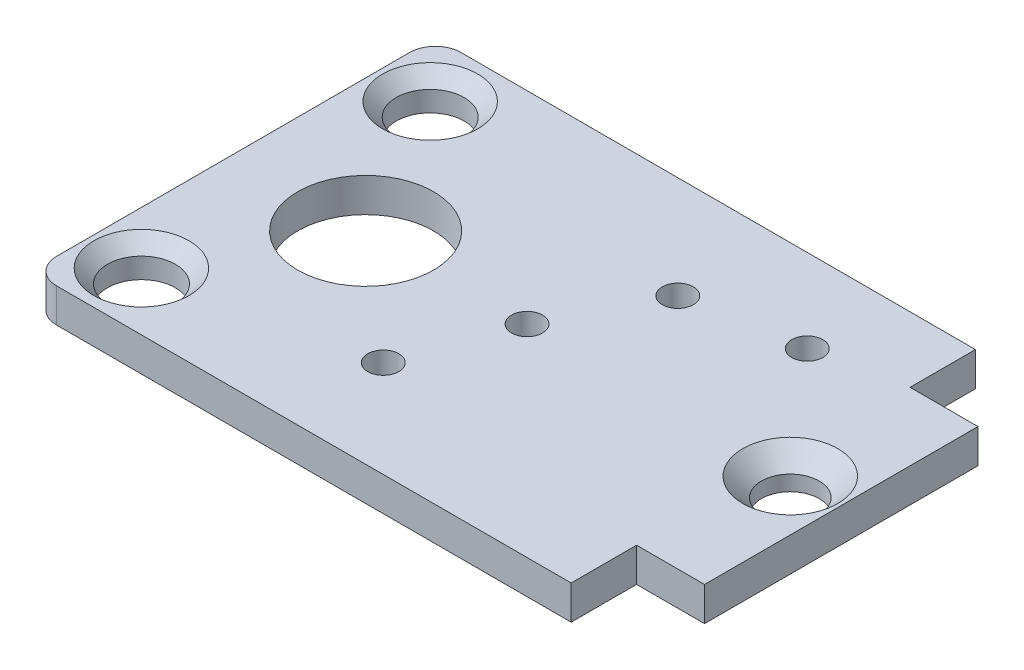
from build123d import *

# Parameters (mm, degrees)
SKETCH1_R           = 2
BOSS_EXTRUDE1_DEPTH = 1
SKETCH2_R           = 1
CUT_EXTRUDE1_DEPTH  = 16.244753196
FILLET1_R           = 0.75
CHAMFER1_SIZE       = 0.4
SKETCH3_R           = 0.4572
CUT_EXTRUDE2_DEPTH  = 16.244753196


with BuildPart() as part:
    # Sketch1 → Boss-Extrude1 (new body)
    with BuildSketch(Plane(origin=(0, 0, 0), x_dir=(1, 0, 0), z_dir=(0, 1, 0))):
        Polygon((12, 5.95), (-3.9, 5.95), (-3.9, -5.95), (12, -5.95), (12, -4.025), (14, -4.025), (14, 4.025), (12, 4.025), align=None)
        with Locations(Location((0, 0, 0), (0, 0, 270))):
            Circle(SKETCH1_R, mode=Mode.SUBTRACT)
    extrude(amount=BOSS_EXTRUDE1_DEPTH)

    # Sketch2 → Cut-Extrude1 (cut, through all)
    with BuildSketch(Plane(origin=(0, 1, 0), x_dir=(1, 0, 0), z_dir=(0, 1, 0))):
        with Locations(Location((-2.35, 4.25, 0), (0, 0, 270))):
            Circle(SKETCH2_R)
        with Locations(Location((-2.35, -4.25, 0), (0, 0, 270))):
            Circle(SKETCH2_R)
    extrude(amount=-CUT_EXTRUDE1_DEPTH, mode=Mode.SUBTRACT)

    # Fillet1
    fillet1_edges = [part.edges().sort_by_distance(p)[0] for p in [
        (-3.9, 0.5, -5.95),
        (-3.9, 0.5, 5.95),
    ]]
    fillet(fillet1_edges, radius=FILLET1_R)

    # Chamfer1
    chamfer1_edges = [part.edges().sort_by_distance(p)[0] for p in [
        (-2.35, 1, -5.25),
        (-2.35, 1, 3.25),
    ]]
    chamfer(chamfer1_edges, length=CHAMFER1_SIZE)

    # Sketch3 → Cut-Extrude2 (cut, through all)
    with BuildSketch(Plane(origin=(0, 1, 0), x_dir=(1, 0, 0), z_dir=(0, 1, 0))):
        with Locations(Location((3.61862915, -3.1, 0), (0, 0, 270))):
            Circle(SKETCH3_R)
        with Locations(Location((4.75, 0, 0), (0, 0, 270))):
            Circle(SKETCH3_R)
        with Locations(Location((6.247772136, 2.94052353, 0), (0, 0, 270))):
            Circle(SKETCH3_R)
        with Locations(Location((9.5, 3.5, 0), (0, 0, 270))):
            Circle(SKETCH3_R)
    extrude(amount=-CUT_EXTRUDE2_DEPTH, mode=Mode.SUBTRACT)

    # Sketch5 → CSK for M1.6 Countersunk Raised Head Scr (revolve, cut)
    with BuildSketch(Plane(origin=(12.5, 1, 0), x_dir=(0, 0, 1), z_dir=(1, 0, 0))):
        Polygon((0, 0), (0, 1), (0.85, 1), (0.85, 0.55), (1.4, 0), align=None)
    revolve(axis=Axis((12.5, 7.35, 0), (0, -1, 0)), mode=Mode.SUBTRACT)


solid = part.part
